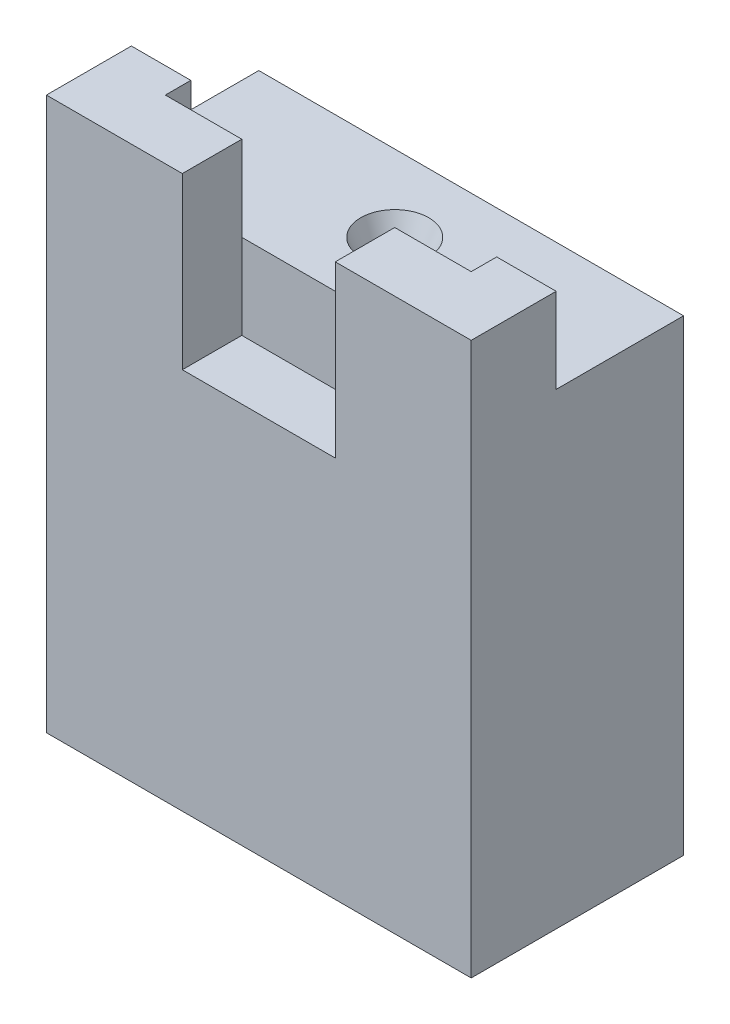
ISO-10303-21;
HEADER;
FILE_DESCRIPTION(('STEP AP214'),'2;1');
FILE_NAME('part.step','',(''),(''),'','','');
FILE_SCHEMA(('AUTOMOTIVE_DESIGN { 1 0 10303 214 1 1 1 1 }'));
ENDSEC;
DATA;
#1=APPLICATION_CONTEXT('core data for automotive mechanical design processes');
#2=APPLICATION_PROTOCOL_DEFINITION('international standard','automotive_design',2000,#1);
#3=PRODUCT_CONTEXT('',#1,'mechanical');
#4=PRODUCT('Part','Part','',(#3));
#5=PRODUCT_RELATED_PRODUCT_CATEGORY('part','',(#4));
#6=PRODUCT_DEFINITION_FORMATION('','',#4);
#7=PRODUCT_DEFINITION_CONTEXT('part definition',#1,'design');
#8=PRODUCT_DEFINITION('design','',#6,#7);
#9=PRODUCT_DEFINITION_SHAPE('','',#8);
#10=(LENGTH_UNIT() NAMED_UNIT(*) SI_UNIT(.MILLI.,.METRE.));
#11=(NAMED_UNIT(*) PLANE_ANGLE_UNIT() SI_UNIT($,.RADIAN.));
#12=(NAMED_UNIT(*) SI_UNIT($,.STERADIAN.) SOLID_ANGLE_UNIT());
#13=UNCERTAINTY_MEASURE_WITH_UNIT(LENGTH_MEASURE(1.E-05),#10,'distance_accuracy_value','');
#14=(GEOMETRIC_REPRESENTATION_CONTEXT(3) GLOBAL_UNCERTAINTY_ASSIGNED_CONTEXT((#13)) GLOBAL_UNIT_ASSIGNED_CONTEXT((#10,
#11,#12)) REPRESENTATION_CONTEXT('',''));
#15=CARTESIAN_POINT('',(0.,0.,0.));
#16=DIRECTION('',(0.,0.,1.));
#17=DIRECTION('',(1.,0.,0.));
#18=AXIS2_PLACEMENT_3D('',#15,#16,#17);
#19=CARTESIAN_POINT('',(-25.,55.,12.5));
#20=DIRECTION('',(0.,1.,0.));
#21=DIRECTION('',(0.,0.,1.));
#22=AXIS2_PLACEMENT_3D('',#19,#20,#21);
#23=PLANE('',#22);
#24=CARTESIAN_POINT('',(0.,55.,-3.5));
#25=DIRECTION('',(0.,-1.,0.));
#26=DIRECTION('',(0.,0.,-1.));
#27=AXIS2_PLACEMENT_3D('',#24,#25,#26);
#28=CIRCLE('',#27,4.);
#29=CARTESIAN_POINT('',(0.,55.,-7.5));
#30=VERTEX_POINT('',#29);
#31=EDGE_CURVE('E232',#30,#30,#28,.T.);
#32=ORIENTED_EDGE('',*,*,#31,.T.);
#33=EDGE_LOOP('',(#32));
#34=FACE_BOUND('',#33,.T.);
#35=DIRECTION('',(0.,0.,1.));
#36=VECTOR('',#35,1.);
#37=CARTESIAN_POINT('',(18.,55.,5.5));
#38=LINE('',#37,#36);
#39=CARTESIAN_POINT('',(18.,55.,2.5));
#40=VERTEX_POINT('',#39);
#41=CARTESIAN_POINT('',(18.,55.,5.5));
#42=VERTEX_POINT('',#41);
#43=EDGE_CURVE('E168',#40,#42,#38,.T.);
#44=ORIENTED_EDGE('',*,*,#43,.F.);
#45=DIRECTION('',(-1.,0.,0.));
#46=VECTOR('',#45,1.);
#47=CARTESIAN_POINT('',(18.,55.,2.5));
#48=LINE('',#47,#46);
#49=CARTESIAN_POINT('',(25.,55.,2.5));
#50=VERTEX_POINT('',#49);
#51=EDGE_CURVE('E178',#50,#40,#48,.T.);
#52=ORIENTED_EDGE('',*,*,#51,.F.);
#53=DIRECTION('',(0.,0.,-1.));
#54=VECTOR('',#53,1.);
#55=CARTESIAN_POINT('',(25.,55.,-12.5));
#56=LINE('',#55,#54);
#57=CARTESIAN_POINT('',(25.,55.,-12.5));
#58=VERTEX_POINT('',#57);
#59=EDGE_CURVE('E264',#50,#58,#56,.T.);
#60=ORIENTED_EDGE('',*,*,#59,.T.);
#61=DIRECTION('',(-1.,0.,0.));
#62=VECTOR('',#61,1.);
#63=CARTESIAN_POINT('',(-25.,55.,-12.5));
#64=LINE('',#63,#62);
#65=CARTESIAN_POINT('',(-25.,55.,-12.5));
#66=VERTEX_POINT('',#65);
#67=EDGE_CURVE('E266',#58,#66,#64,.T.);
#68=ORIENTED_EDGE('',*,*,#67,.T.);
#69=DIRECTION('',(0.,0.,1.));
#70=VECTOR('',#69,1.);
#71=CARTESIAN_POINT('',(-25.,55.,-12.5));
#72=LINE('',#71,#70);
#73=CARTESIAN_POINT('',(-25.,55.,2.5));
#74=VERTEX_POINT('',#73);
#75=EDGE_CURVE('E53',#66,#74,#72,.T.);
#76=ORIENTED_EDGE('',*,*,#75,.T.);
#77=DIRECTION('',(-1.,0.,0.));
#78=VECTOR('',#77,1.);
#79=CARTESIAN_POINT('',(-18.,55.,2.5));
#80=LINE('',#79,#78);
#81=CARTESIAN_POINT('',(-18.,55.,2.5));
#82=VERTEX_POINT('',#81);
#83=EDGE_CURVE('E48',#82,#74,#80,.T.);
#84=ORIENTED_EDGE('',*,*,#83,.F.);
#85=DIRECTION('',(0.,0.,-1.));
#86=VECTOR('',#85,1.);
#87=CARTESIAN_POINT('',(-18.,55.,5.5));
#88=LINE('',#87,#86);
#89=CARTESIAN_POINT('',(-18.,55.,5.5));
#90=VERTEX_POINT('',#89);
#91=EDGE_CURVE('E208',#90,#82,#88,.T.);
#92=ORIENTED_EDGE('',*,*,#91,.F.);
#93=DIRECTION('',(-1.,0.,0.));
#94=VECTOR('',#93,1.);
#95=CARTESIAN_POINT('',(-9.,55.,5.5));
#96=LINE('',#95,#94);
#97=CARTESIAN_POINT('',(-9.,55.,5.5));
#98=VERTEX_POINT('',#97);
#99=EDGE_CURVE('E189',#98,#90,#96,.T.);
#100=ORIENTED_EDGE('',*,*,#99,.F.);
#101=DIRECTION('',(-1.,0.,0.));
#102=VECTOR('',#101,1.);
#103=CARTESIAN_POINT('',(-9.,55.,5.5));
#104=LINE('',#103,#102);
#105=CARTESIAN_POINT('',(9.,55.,5.49999999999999));
#106=VERTEX_POINT('',#105);
#107=EDGE_CURVE('E237',#106,#98,#104,.T.);
#108=ORIENTED_EDGE('',*,*,#107,.F.);
#109=DIRECTION('',(-1.,0.,0.));
#110=VECTOR('',#109,1.);
#111=CARTESIAN_POINT('',(9.,55.,5.5));
#112=LINE('',#111,#110);
#113=EDGE_CURVE('E165',#42,#106,#112,.T.);
#114=ORIENTED_EDGE('',*,*,#113,.F.);
#115=EDGE_LOOP('',(#44,#52,#60,#68,#76,#84,#92,#100,#108,#114));
#116=FACE_BOUND('',#115,.T.);
#117=ADVANCED_FACE('F31',(#34,#116),#23,.T.);
#118=CARTESIAN_POINT('',(-25.,55.,-12.5));
#119=DIRECTION('',(1.,0.,0.));
#120=DIRECTION('',(0.,0.,-1.));
#121=AXIS2_PLACEMENT_3D('',#118,#119,#120);
#122=PLANE('',#121);
#123=DIRECTION('',(0.,0.,1.));
#124=VECTOR('',#123,1.);
#125=CARTESIAN_POINT('',(-25.,0.,-12.5));
#126=LINE('',#125,#124);
#127=CARTESIAN_POINT('',(-25.,0.,-12.5));
#128=VERTEX_POINT('',#127);
#129=CARTESIAN_POINT('',(-25.,0.,12.5));
#130=VERTEX_POINT('',#129);
#131=EDGE_CURVE('E256',#128,#130,#126,.T.);
#132=ORIENTED_EDGE('',*,*,#131,.T.);
#133=DIRECTION('',(0.,-1.,0.));
#134=VECTOR('',#133,1.);
#135=CARTESIAN_POINT('',(-25.,55.,12.5));
#136=LINE('',#135,#134);
#137=CARTESIAN_POINT('',(-25.,65.,12.5));
#138=VERTEX_POINT('',#137);
#139=EDGE_CURVE('E11',#138,#130,#136,.T.);
#140=ORIENTED_EDGE('',*,*,#139,.F.);
#141=DIRECTION('',(0.,0.,1.));
#142=VECTOR('',#141,1.);
#143=CARTESIAN_POINT('',(-25.,65.,2.5));
#144=LINE('',#143,#142);
#145=CARTESIAN_POINT('',(-25.,65.,2.5));
#146=VERTEX_POINT('',#145);
#147=EDGE_CURVE('E199',#146,#138,#144,.T.);
#148=ORIENTED_EDGE('',*,*,#147,.F.);
#149=DIRECTION('',(0.,-1.,0.));
#150=VECTOR('',#149,1.);
#151=CARTESIAN_POINT('',(-25.,65.,2.5));
#152=LINE('',#151,#150);
#153=EDGE_CURVE('E205',#146,#74,#152,.T.);
#154=ORIENTED_EDGE('',*,*,#153,.T.);
#155=ORIENTED_EDGE('',*,*,#75,.F.);
#156=DIRECTION('',(0.,-1.,0.));
#157=VECTOR('',#156,1.);
#158=CARTESIAN_POINT('',(-25.,55.,-12.5));
#159=LINE('',#158,#157);
#160=EDGE_CURVE('E268',#66,#128,#159,.T.);
#161=ORIENTED_EDGE('',*,*,#160,.T.);
#162=EDGE_LOOP('',(#132,#140,#148,#154,#155,#161));
#163=FACE_BOUND('',#162,.T.);
#164=ADVANCED_FACE('F33',(#163),#122,.F.);
#165=CARTESIAN_POINT('',(-25.,55.,12.5));
#166=DIRECTION('',(0.,0.,-1.));
#167=DIRECTION('',(-1.,0.,0.));
#168=AXIS2_PLACEMENT_3D('',#165,#166,#167);
#169=PLANE('',#168);
#170=DIRECTION('',(1.,0.,0.));
#171=VECTOR('',#170,1.);
#172=CARTESIAN_POINT('',(-9.,45.,12.5));
#173=LINE('',#172,#171);
#174=CARTESIAN_POINT('',(-9.,45.,12.5));
#175=VERTEX_POINT('',#174);
#176=CARTESIAN_POINT('',(9.,45.,12.5));
#177=VERTEX_POINT('',#176);
#178=EDGE_CURVE('E241',#175,#177,#173,.T.);
#179=ORIENTED_EDGE('',*,*,#178,.F.);
#180=DIRECTION('',(0.,1.,0.));
#181=VECTOR('',#180,1.);
#182=CARTESIAN_POINT('',(-9.,45.,12.5));
#183=LINE('',#182,#181);
#184=CARTESIAN_POINT('',(-9.,65.,12.5));
#185=VERTEX_POINT('',#184);
#186=EDGE_CURVE('E250',#175,#185,#183,.T.);
#187=ORIENTED_EDGE('',*,*,#186,.T.);
#188=DIRECTION('',(1.,0.,0.));
#189=VECTOR('',#188,1.);
#190=CARTESIAN_POINT('',(-25.,65.,12.5));
#191=LINE('',#190,#189);
#192=EDGE_CURVE('E202',#138,#185,#191,.T.);
#193=ORIENTED_EDGE('',*,*,#192,.F.);
#194=ORIENTED_EDGE('',*,*,#139,.T.);
#195=DIRECTION('',(1.,0.,0.));
#196=VECTOR('',#195,1.);
#197=CARTESIAN_POINT('',(-25.,0.,12.5));
#198=LINE('',#197,#196);
#199=CARTESIAN_POINT('',(25.,0.,12.5));
#200=VERTEX_POINT('',#199);
#201=EDGE_CURVE('E147',#130,#200,#198,.T.);
#202=ORIENTED_EDGE('',*,*,#201,.T.);
#203=DIRECTION('',(0.,-1.,0.));
#204=VECTOR('',#203,1.);
#205=CARTESIAN_POINT('',(25.,55.,12.5));
#206=LINE('',#205,#204);
#207=CARTESIAN_POINT('',(25.,65.,12.5));
#208=VERTEX_POINT('',#207);
#209=EDGE_CURVE('E40',#208,#200,#206,.T.);
#210=ORIENTED_EDGE('',*,*,#209,.F.);
#211=DIRECTION('',(1.,0.,0.));
#212=VECTOR('',#211,1.);
#213=CARTESIAN_POINT('',(25.,65.,12.5));
#214=LINE('',#213,#212);
#215=CARTESIAN_POINT('',(9.,65.,12.5));
#216=VERTEX_POINT('',#215);
#217=EDGE_CURVE('E146',#216,#208,#214,.T.);
#218=ORIENTED_EDGE('',*,*,#217,.F.);
#219=DIRECTION('',(0.,1.,0.));
#220=VECTOR('',#219,1.);
#221=CARTESIAN_POINT('',(9.,45.,12.5));
#222=LINE('',#221,#220);
#223=EDGE_CURVE('E260',#177,#216,#222,.T.);
#224=ORIENTED_EDGE('',*,*,#223,.F.);
#225=EDGE_LOOP('',(#179,#187,#193,#194,#202,#210,#218,#224));
#226=FACE_BOUND('',#225,.T.);
#227=ADVANCED_FACE('F143',(#226),#169,.F.);
#228=CARTESIAN_POINT('',(25.,55.,-12.5));
#229=DIRECTION('',(-1.,0.,0.));
#230=DIRECTION('',(0.,0.,1.));
#231=AXIS2_PLACEMENT_3D('',#228,#229,#230);
#232=PLANE('',#231);
#233=DIRECTION('',(0.,0.,-1.));
#234=VECTOR('',#233,1.);
#235=CARTESIAN_POINT('',(25.,0.,-12.5));
#236=LINE('',#235,#234);
#237=CARTESIAN_POINT('',(25.,0.,-12.5));
#238=VERTEX_POINT('',#237);
#239=EDGE_CURVE('E272',#200,#238,#236,.T.);
#240=ORIENTED_EDGE('',*,*,#239,.T.);
#241=DIRECTION('',(0.,-1.,0.));
#242=VECTOR('',#241,1.);
#243=CARTESIAN_POINT('',(25.,55.,-12.5));
#244=LINE('',#243,#242);
#245=EDGE_CURVE('E150',#58,#238,#244,.T.);
#246=ORIENTED_EDGE('',*,*,#245,.F.);
#247=ORIENTED_EDGE('',*,*,#59,.F.);
#248=DIRECTION('',(0.,-1.,0.));
#249=VECTOR('',#248,1.);
#250=CARTESIAN_POINT('',(25.,65.,2.5));
#251=LINE('',#250,#249);
#252=CARTESIAN_POINT('',(25.,65.,2.5));
#253=VERTEX_POINT('',#252);
#254=EDGE_CURVE('E156',#253,#50,#251,.T.);
#255=ORIENTED_EDGE('',*,*,#254,.F.);
#256=DIRECTION('',(0.,0.,-1.));
#257=VECTOR('',#256,1.);
#258=CARTESIAN_POINT('',(25.,65.,2.5));
#259=LINE('',#258,#257);
#260=EDGE_CURVE('E153',#208,#253,#259,.T.);
#261=ORIENTED_EDGE('',*,*,#260,.F.);
#262=ORIENTED_EDGE('',*,*,#209,.T.);
#263=EDGE_LOOP('',(#240,#246,#247,#255,#261,#262));
#264=FACE_BOUND('',#263,.T.);
#265=ADVANCED_FACE('F154',(#264),#232,.F.);
#266=CARTESIAN_POINT('',(-25.,55.,-12.5));
#267=DIRECTION('',(0.,0.,1.));
#268=DIRECTION('',(1.,0.,0.));
#269=AXIS2_PLACEMENT_3D('',#266,#267,#268);
#270=PLANE('',#269);
#271=DIRECTION('',(-1.,0.,0.));
#272=VECTOR('',#271,1.);
#273=CARTESIAN_POINT('',(-25.,0.,-12.5));
#274=LINE('',#273,#272);
#275=EDGE_CURVE('E274',#238,#128,#274,.T.);
#276=ORIENTED_EDGE('',*,*,#275,.T.);
#277=ORIENTED_EDGE('',*,*,#160,.F.);
#278=ORIENTED_EDGE('',*,*,#67,.F.);
#279=ORIENTED_EDGE('',*,*,#245,.T.);
#280=EDGE_LOOP('',(#276,#277,#278,#279));
#281=FACE_BOUND('',#280,.T.);
#282=ADVANCED_FACE('F283',(#281),#270,.F.);
#283=CARTESIAN_POINT('',(-25.,0.,12.5));
#284=DIRECTION('',(0.,1.,0.));
#285=DIRECTION('',(0.,0.,1.));
#286=AXIS2_PLACEMENT_3D('',#283,#284,#285);
#287=PLANE('',#286);
#288=ORIENTED_EDGE('',*,*,#131,.F.);
#289=ORIENTED_EDGE('',*,*,#275,.F.);
#290=ORIENTED_EDGE('',*,*,#239,.F.);
#291=ORIENTED_EDGE('',*,*,#201,.F.);
#292=EDGE_LOOP('',(#288,#289,#290,#291));
#293=FACE_BOUND('',#292,.T.);
#294=ADVANCED_FACE('F287',(#293),#287,.F.);
#295=CARTESIAN_POINT('',(-9.,45.,5.5));
#296=DIRECTION('',(-1.,0.,0.));
#297=DIRECTION('',(0.,0.,1.));
#298=AXIS2_PLACEMENT_3D('',#295,#296,#297);
#299=PLANE('',#298);
#300=DIRECTION('',(0.,1.,0.));
#301=VECTOR('',#300,1.);
#302=CARTESIAN_POINT('',(-9.,45.,5.5));
#303=LINE('',#302,#301);
#304=CARTESIAN_POINT('',(-9.,45.,5.5));
#305=VERTEX_POINT('',#304);
#306=EDGE_CURVE('E253',#305,#98,#303,.T.);
#307=ORIENTED_EDGE('',*,*,#306,.T.);
#308=DIRECTION('',(0.,-1.,0.));
#309=VECTOR('',#308,1.);
#310=CARTESIAN_POINT('',(-9.,65.,5.5));
#311=LINE('',#310,#309);
#312=CARTESIAN_POINT('',(-9.,65.,5.5));
#313=VERTEX_POINT('',#312);
#314=EDGE_CURVE('E227',#313,#98,#311,.T.);
#315=ORIENTED_EDGE('',*,*,#314,.F.);
#316=DIRECTION('',(0.,0.,-1.));
#317=VECTOR('',#316,1.);
#318=CARTESIAN_POINT('',(-9.,65.,12.5));
#319=LINE('',#318,#317);
#320=EDGE_CURVE('E190',#185,#313,#319,.T.);
#321=ORIENTED_EDGE('',*,*,#320,.F.);
#322=ORIENTED_EDGE('',*,*,#186,.F.);
#323=DIRECTION('',(0.,0.,1.));
#324=VECTOR('',#323,1.);
#325=CARTESIAN_POINT('',(-9.,45.,5.5));
#326=LINE('',#325,#324);
#327=EDGE_CURVE('E238',#305,#175,#326,.T.);
#328=ORIENTED_EDGE('',*,*,#327,.F.);
#329=EDGE_LOOP('',(#307,#315,#321,#322,#328));
#330=FACE_BOUND('',#329,.T.);
#331=ADVANCED_FACE('F294',(#330),#299,.F.);
#332=CARTESIAN_POINT('',(-9.,45.,5.5));
#333=DIRECTION('',(0.,0.,-1.));
#334=DIRECTION('',(-1.,0.,0.));
#335=AXIS2_PLACEMENT_3D('',#332,#333,#334);
#336=PLANE('',#335);
#337=ORIENTED_EDGE('',*,*,#107,.T.);
#338=ORIENTED_EDGE('',*,*,#306,.F.);
#339=DIRECTION('',(-1.,0.,0.));
#340=VECTOR('',#339,1.);
#341=CARTESIAN_POINT('',(-9.,45.,5.5));
#342=LINE('',#341,#340);
#343=CARTESIAN_POINT('',(9.,45.,5.49999999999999));
#344=VERTEX_POINT('',#343);
#345=EDGE_CURVE('E247',#344,#305,#342,.T.);
#346=ORIENTED_EDGE('',*,*,#345,.F.);
#347=DIRECTION('',(0.,1.,0.));
#348=VECTOR('',#347,1.);
#349=CARTESIAN_POINT('',(9.,45.,5.49999999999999));
#350=LINE('',#349,#348);
#351=EDGE_CURVE('E257',#344,#106,#350,.T.);
#352=ORIENTED_EDGE('',*,*,#351,.T.);
#353=EDGE_LOOP('',(#337,#338,#346,#352));
#354=FACE_BOUND('',#353,.T.);
#355=ADVANCED_FACE('F300',(#354),#336,.F.);
#356=CARTESIAN_POINT('',(9.,45.,5.49999999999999));
#357=DIRECTION('',(1.,0.,0.));
#358=DIRECTION('',(0.,0.,-1.));
#359=AXIS2_PLACEMENT_3D('',#356,#357,#358);
#360=PLANE('',#359);
#361=ORIENTED_EDGE('',*,*,#223,.T.);
#362=DIRECTION('',(0.,0.,1.));
#363=VECTOR('',#362,1.);
#364=CARTESIAN_POINT('',(9.,65.,12.5));
#365=LINE('',#364,#363);
#366=CARTESIAN_POINT('',(9.,65.,5.5));
#367=VERTEX_POINT('',#366);
#368=EDGE_CURVE('E164',#367,#216,#365,.T.);
#369=ORIENTED_EDGE('',*,*,#368,.F.);
#370=DIRECTION('',(0.,-1.,0.));
#371=VECTOR('',#370,1.);
#372=CARTESIAN_POINT('',(9.,65.,5.5));
#373=LINE('',#372,#371);
#374=EDGE_CURVE('E177',#367,#106,#373,.T.);
#375=ORIENTED_EDGE('',*,*,#374,.T.);
#376=ORIENTED_EDGE('',*,*,#351,.F.);
#377=DIRECTION('',(0.,0.,-1.));
#378=VECTOR('',#377,1.);
#379=CARTESIAN_POINT('',(9.,45.,5.49999999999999));
#380=LINE('',#379,#378);
#381=EDGE_CURVE('E244',#177,#344,#380,.T.);
#382=ORIENTED_EDGE('',*,*,#381,.F.);
#383=EDGE_LOOP('',(#361,#369,#375,#376,#382));
#384=FACE_BOUND('',#383,.T.);
#385=ADVANCED_FACE('F358',(#384),#360,.F.);
#386=CARTESIAN_POINT('',(-9.,45.,12.5));
#387=DIRECTION('',(0.,1.,0.));
#388=DIRECTION('',(0.,0.,1.));
#389=AXIS2_PLACEMENT_3D('',#386,#387,#388);
#390=PLANE('',#389);
#391=ORIENTED_EDGE('',*,*,#327,.T.);
#392=ORIENTED_EDGE('',*,*,#178,.T.);
#393=ORIENTED_EDGE('',*,*,#381,.T.);
#394=ORIENTED_EDGE('',*,*,#345,.T.);
#395=EDGE_LOOP('',(#391,#392,#393,#394));
#396=FACE_BOUND('',#395,.T.);
#397=ADVANCED_FACE('F297',(#396),#390,.T.);
#398=CARTESIAN_POINT('',(0.,55.,-3.5));
#399=DIRECTION('',(0.,1.,0.));
#400=DIRECTION('',(0.,0.,1.));
#401=AXIS2_PLACEMENT_3D('',#398,#399,#400);
#402=CONICAL_SURFACE('',#401,4.,0.400770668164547);
#403=CARTESIAN_POINT('',(0.,45.5594013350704,-3.5));
#404=VERTEX_POINT('',#403);
#405=VERTEX_LOOP('',#404);
#406=FACE_BOUND('',#405,.T.);
#407=ORIENTED_EDGE('',*,*,#31,.F.);
#408=EDGE_LOOP('',(#407));
#409=FACE_BOUND('',#408,.T.);
#410=ADVANCED_FACE('F371',(#406,#409),#402,.F.);
#411=CARTESIAN_POINT('',(-9.,65.,5.5));
#412=DIRECTION('',(0.,0.,1.));
#413=DIRECTION('',(1.,0.,0.));
#414=AXIS2_PLACEMENT_3D('',#411,#412,#413);
#415=PLANE('',#414);
#416=ORIENTED_EDGE('',*,*,#99,.T.);
#417=DIRECTION('',(0.,-1.,0.));
#418=VECTOR('',#417,1.);
#419=CARTESIAN_POINT('',(-18.,65.,5.5));
#420=LINE('',#419,#418);
#421=CARTESIAN_POINT('',(-18.,65.,5.5));
#422=VERTEX_POINT('',#421);
#423=EDGE_CURVE('E222',#422,#90,#420,.T.);
#424=ORIENTED_EDGE('',*,*,#423,.F.);
#425=DIRECTION('',(-1.,0.,0.));
#426=VECTOR('',#425,1.);
#427=CARTESIAN_POINT('',(-9.,65.,5.5));
#428=LINE('',#427,#426);
#429=EDGE_CURVE('E193',#313,#422,#428,.T.);
#430=ORIENTED_EDGE('',*,*,#429,.F.);
#431=ORIENTED_EDGE('',*,*,#314,.T.);
#432=EDGE_LOOP('',(#416,#424,#430,#431));
#433=FACE_BOUND('',#432,.T.);
#434=ADVANCED_FACE('F303',(#433),#415,.F.);
#435=CARTESIAN_POINT('',(-18.,65.,5.5));
#436=DIRECTION('',(-1.,0.,0.));
#437=DIRECTION('',(0.,0.,1.));
#438=AXIS2_PLACEMENT_3D('',#435,#436,#437);
#439=PLANE('',#438);
#440=ORIENTED_EDGE('',*,*,#91,.T.);
#441=DIRECTION('',(0.,-1.,0.));
#442=VECTOR('',#441,1.);
#443=CARTESIAN_POINT('',(-18.,65.,2.5));
#444=LINE('',#443,#442);
#445=CARTESIAN_POINT('',(-18.,65.,2.5));
#446=VERTEX_POINT('',#445);
#447=EDGE_CURVE('E212',#446,#82,#444,.T.);
#448=ORIENTED_EDGE('',*,*,#447,.F.);
#449=DIRECTION('',(0.,0.,-1.));
#450=VECTOR('',#449,1.);
#451=CARTESIAN_POINT('',(-18.,65.,5.5));
#452=LINE('',#451,#450);
#453=EDGE_CURVE('E195',#422,#446,#452,.T.);
#454=ORIENTED_EDGE('',*,*,#453,.F.);
#455=ORIENTED_EDGE('',*,*,#423,.T.);
#456=EDGE_LOOP('',(#440,#448,#454,#455));
#457=FACE_BOUND('',#456,.T.);
#458=ADVANCED_FACE('F304',(#457),#439,.F.);
#459=CARTESIAN_POINT('',(-18.,65.,2.5));
#460=DIRECTION('',(0.,0.,1.));
#461=DIRECTION('',(1.,0.,0.));
#462=AXIS2_PLACEMENT_3D('',#459,#460,#461);
#463=PLANE('',#462);
#464=ORIENTED_EDGE('',*,*,#83,.T.);
#465=ORIENTED_EDGE('',*,*,#153,.F.);
#466=DIRECTION('',(-1.,0.,0.));
#467=VECTOR('',#466,1.);
#468=CARTESIAN_POINT('',(-18.,65.,2.5));
#469=LINE('',#468,#467);
#470=EDGE_CURVE('E197',#446,#146,#469,.T.);
#471=ORIENTED_EDGE('',*,*,#470,.F.);
#472=ORIENTED_EDGE('',*,*,#447,.T.);
#473=EDGE_LOOP('',(#464,#465,#471,#472));
#474=FACE_BOUND('',#473,.T.);
#475=ADVANCED_FACE('F305',(#474),#463,.F.);
#476=CARTESIAN_POINT('',(-9.,65.,12.5));
#477=DIRECTION('',(0.,-1.,0.));
#478=DIRECTION('',(0.,0.,-1.));
#479=AXIS2_PLACEMENT_3D('',#476,#477,#478);
#480=PLANE('',#479);
#481=ORIENTED_EDGE('',*,*,#320,.T.);
#482=ORIENTED_EDGE('',*,*,#429,.T.);
#483=ORIENTED_EDGE('',*,*,#453,.T.);
#484=ORIENTED_EDGE('',*,*,#470,.T.);
#485=ORIENTED_EDGE('',*,*,#147,.T.);
#486=ORIENTED_EDGE('',*,*,#192,.T.);
#487=EDGE_LOOP('',(#481,#482,#483,#484,#485,#486));
#488=FACE_BOUND('',#487,.T.);
#489=ADVANCED_FACE('F290',(#488),#480,.F.);
#490=CARTESIAN_POINT('',(18.,65.,2.5));
#491=DIRECTION('',(0.,0.,1.));
#492=DIRECTION('',(1.,0.,0.));
#493=AXIS2_PLACEMENT_3D('',#490,#491,#492);
#494=PLANE('',#493);
#495=ORIENTED_EDGE('',*,*,#51,.T.);
#496=DIRECTION('',(0.,-1.,0.));
#497=VECTOR('',#496,1.);
#498=CARTESIAN_POINT('',(18.,65.,2.5));
#499=LINE('',#498,#497);
#500=CARTESIAN_POINT('',(18.,65.,2.5));
#501=VERTEX_POINT('',#500);
#502=EDGE_CURVE('E185',#501,#40,#499,.T.);
#503=ORIENTED_EDGE('',*,*,#502,.F.);
#504=DIRECTION('',(-1.,0.,0.));
#505=VECTOR('',#504,1.);
#506=CARTESIAN_POINT('',(18.,65.,2.5));
#507=LINE('',#506,#505);
#508=EDGE_CURVE('E159',#253,#501,#507,.T.);
#509=ORIENTED_EDGE('',*,*,#508,.F.);
#510=ORIENTED_EDGE('',*,*,#254,.T.);
#511=EDGE_LOOP('',(#495,#503,#509,#510));
#512=FACE_BOUND('',#511,.T.);
#513=ADVANCED_FACE('F312',(#512),#494,.F.);
#514=CARTESIAN_POINT('',(18.,65.,5.5));
#515=DIRECTION('',(1.,0.,0.));
#516=DIRECTION('',(0.,0.,-1.));
#517=AXIS2_PLACEMENT_3D('',#514,#515,#516);
#518=PLANE('',#517);
#519=ORIENTED_EDGE('',*,*,#43,.T.);
#520=DIRECTION('',(0.,-1.,0.));
#521=VECTOR('',#520,1.);
#522=CARTESIAN_POINT('',(18.,65.,5.5));
#523=LINE('',#522,#521);
#524=CARTESIAN_POINT('',(18.,65.,5.5));
#525=VERTEX_POINT('',#524);
#526=EDGE_CURVE('E182',#525,#42,#523,.T.);
#527=ORIENTED_EDGE('',*,*,#526,.F.);
#528=DIRECTION('',(0.,0.,1.));
#529=VECTOR('',#528,1.);
#530=CARTESIAN_POINT('',(18.,65.,5.5));
#531=LINE('',#530,#529);
#532=EDGE_CURVE('E172',#501,#525,#531,.T.);
#533=ORIENTED_EDGE('',*,*,#532,.F.);
#534=ORIENTED_EDGE('',*,*,#502,.T.);
#535=EDGE_LOOP('',(#519,#527,#533,#534));
#536=FACE_BOUND('',#535,.T.);
#537=ADVANCED_FACE('F407',(#536),#518,.F.);
#538=CARTESIAN_POINT('',(9.,65.,5.5));
#539=DIRECTION('',(0.,0.,1.));
#540=DIRECTION('',(1.,0.,0.));
#541=AXIS2_PLACEMENT_3D('',#538,#539,#540);
#542=PLANE('',#541);
#543=ORIENTED_EDGE('',*,*,#113,.T.);
#544=ORIENTED_EDGE('',*,*,#374,.F.);
#545=DIRECTION('',(-1.,0.,0.));
#546=VECTOR('',#545,1.);
#547=CARTESIAN_POINT('',(9.,65.,5.5));
#548=LINE('',#547,#546);
#549=EDGE_CURVE('E174',#525,#367,#548,.T.);
#550=ORIENTED_EDGE('',*,*,#549,.F.);
#551=ORIENTED_EDGE('',*,*,#526,.T.);
#552=EDGE_LOOP('',(#543,#544,#550,#551));
#553=FACE_BOUND('',#552,.T.);
#554=ADVANCED_FACE('F417',(#553),#542,.F.);
#555=CARTESIAN_POINT('',(9.,65.,12.5));
#556=DIRECTION('',(0.,-1.,0.));
#557=DIRECTION('',(0.,0.,-1.));
#558=AXIS2_PLACEMENT_3D('',#555,#556,#557);
#559=PLANE('',#558);
#560=ORIENTED_EDGE('',*,*,#217,.T.);
#561=ORIENTED_EDGE('',*,*,#260,.T.);
#562=ORIENTED_EDGE('',*,*,#508,.T.);
#563=ORIENTED_EDGE('',*,*,#532,.T.);
#564=ORIENTED_EDGE('',*,*,#549,.T.);
#565=ORIENTED_EDGE('',*,*,#368,.T.);
#566=EDGE_LOOP('',(#560,#561,#562,#563,#564,#565));
#567=FACE_BOUND('',#566,.T.);
#568=ADVANCED_FACE('F162',(#567),#559,.F.);
#569=CLOSED_SHELL('',(#117,#164,#227,#265,#282,#294,#331,#355,#385,#397,#410,#434,#458,#475,
#489,#513,#537,#554,#568));
#570=MANIFOLD_SOLID_BREP('B2',#569);
#571=ADVANCED_BREP_SHAPE_REPRESENTATION('',(#18,#570),#14);
#572=SHAPE_DEFINITION_REPRESENTATION(#9,#571);
ENDSEC;
END-ISO-10303-21;
